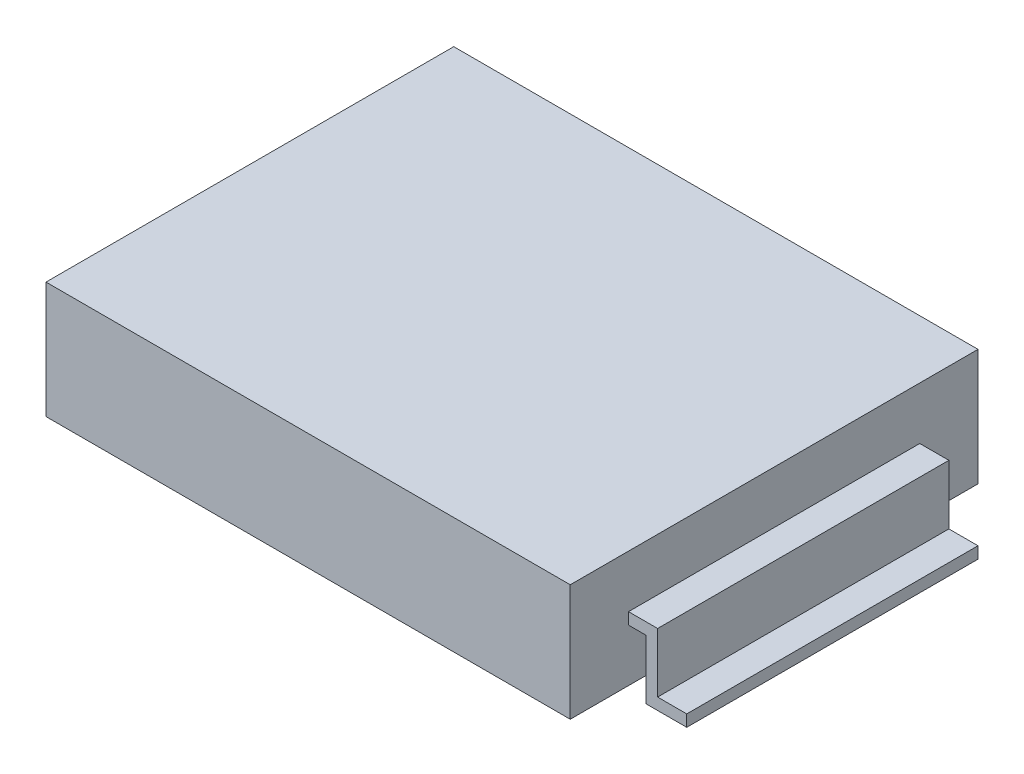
ISO-10303-21;
HEADER;
FILE_DESCRIPTION(('STEP AP214'),'2;1');
FILE_NAME('part.step','',(''),(''),'','','');
FILE_SCHEMA(('AUTOMOTIVE_DESIGN { 1 0 10303 214 1 1 1 1 }'));
ENDSEC;
DATA;
#1=APPLICATION_CONTEXT('core data for automotive mechanical design processes');
#2=APPLICATION_PROTOCOL_DEFINITION('international standard','automotive_design',2000,#1);
#3=PRODUCT_CONTEXT('',#1,'mechanical');
#4=PRODUCT('Part','Part','',(#3));
#5=PRODUCT_RELATED_PRODUCT_CATEGORY('part','',(#4));
#6=PRODUCT_DEFINITION_FORMATION('','',#4);
#7=PRODUCT_DEFINITION_CONTEXT('part definition',#1,'design');
#8=PRODUCT_DEFINITION('design','',#6,#7);
#9=PRODUCT_DEFINITION_SHAPE('','',#8);
#10=(LENGTH_UNIT() NAMED_UNIT(*) SI_UNIT(.MILLI.,.METRE.));
#11=(NAMED_UNIT(*) PLANE_ANGLE_UNIT() SI_UNIT($,.RADIAN.));
#12=(NAMED_UNIT(*) SI_UNIT($,.STERADIAN.) SOLID_ANGLE_UNIT());
#13=UNCERTAINTY_MEASURE_WITH_UNIT(LENGTH_MEASURE(1.E-05),#10,'distance_accuracy_value','');
#14=(GEOMETRIC_REPRESENTATION_CONTEXT(3) GLOBAL_UNCERTAINTY_ASSIGNED_CONTEXT((#13)) GLOBAL_UNIT_ASSIGNED_CONTEXT((#10,
#11,#12)) REPRESENTATION_CONTEXT('',''));
#15=CARTESIAN_POINT('',(0.,0.,0.));
#16=DIRECTION('',(0.,0.,1.));
#17=DIRECTION('',(1.,0.,0.));
#18=AXIS2_PLACEMENT_3D('',#15,#16,#17);
#19=CARTESIAN_POINT('',(-2.25,0.5,-1.75));
#20=DIRECTION('',(1.,0.,0.));
#21=DIRECTION('',(0.,0.,-1.));
#22=AXIS2_PLACEMENT_3D('',#19,#20,#21);
#23=PLANE('',#22);
#24=DIRECTION('',(0.,0.,1.));
#25=VECTOR('',#24,1.);
#26=CARTESIAN_POINT('',(-2.25,-0.5,-1.75));
#27=LINE('',#26,#25);
#28=CARTESIAN_POINT('',(-2.25,-0.5,-1.75));
#29=VERTEX_POINT('',#28);
#30=CARTESIAN_POINT('',(-2.25,-0.5,1.75));
#31=VERTEX_POINT('',#30);
#32=EDGE_CURVE('E300',#29,#31,#27,.T.);
#33=ORIENTED_EDGE('',*,*,#32,.T.);
#34=DIRECTION('',(0.,-1.,0.));
#35=VECTOR('',#34,1.);
#36=CARTESIAN_POINT('',(-2.25,0.5,1.75));
#37=LINE('',#36,#35);
#38=CARTESIAN_POINT('',(-2.25,0.5,1.75));
#39=VERTEX_POINT('',#38);
#40=EDGE_CURVE('E11',#39,#31,#37,.T.);
#41=ORIENTED_EDGE('',*,*,#40,.F.);
#42=DIRECTION('',(0.,0.,1.));
#43=VECTOR('',#42,1.);
#44=CARTESIAN_POINT('',(-2.25,0.5,-1.75));
#45=LINE('',#44,#43);
#46=CARTESIAN_POINT('',(-2.25,0.5,-1.75));
#47=VERTEX_POINT('',#46);
#48=EDGE_CURVE('E301',#47,#39,#45,.T.);
#49=ORIENTED_EDGE('',*,*,#48,.F.);
#50=DIRECTION('',(0.,-1.,0.));
#51=VECTOR('',#50,1.);
#52=CARTESIAN_POINT('',(-2.25,0.5,-1.75));
#53=LINE('',#52,#51);
#54=EDGE_CURVE('E311',#47,#29,#53,.T.);
#55=ORIENTED_EDGE('',*,*,#54,.T.);
#56=EDGE_LOOP('',(#33,#41,#49,#55));
#57=FACE_BOUND('',#56,.T.);
#58=DIRECTION('',(0.,-1.,0.));
#59=VECTOR('',#58,1.);
#60=CARTESIAN_POINT('',(-2.25,0.0499999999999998,1.25));
#61=LINE('',#60,#59);
#62=CARTESIAN_POINT('',(-2.25,0.0499999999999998,1.25));
#63=VERTEX_POINT('',#62);
#64=CARTESIAN_POINT('',(-2.25,-0.0500000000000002,1.25));
#65=VERTEX_POINT('',#64);
#66=EDGE_CURVE('E253',#63,#65,#61,.T.);
#67=ORIENTED_EDGE('',*,*,#66,.T.);
#68=DIRECTION('',(0.,0.,-1.));
#69=VECTOR('',#68,1.);
#70=CARTESIAN_POINT('',(-2.25,-0.0500000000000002,1.25));
#71=LINE('',#70,#69);
#72=CARTESIAN_POINT('',(-2.25,-0.0500000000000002,-1.25));
#73=VERTEX_POINT('',#72);
#74=EDGE_CURVE('E289',#65,#73,#71,.T.);
#75=ORIENTED_EDGE('',*,*,#74,.T.);
#76=DIRECTION('',(0.,-1.,0.));
#77=VECTOR('',#76,1.);
#78=CARTESIAN_POINT('',(-2.25,0.0499999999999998,-1.25));
#79=LINE('',#78,#77);
#80=CARTESIAN_POINT('',(-2.25,0.0499999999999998,-1.25));
#81=VERTEX_POINT('',#80);
#82=EDGE_CURVE('E275',#81,#73,#79,.T.);
#83=ORIENTED_EDGE('',*,*,#82,.F.);
#84=DIRECTION('',(0.,0.,-1.));
#85=VECTOR('',#84,1.);
#86=CARTESIAN_POINT('',(-2.25,0.0499999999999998,1.25));
#87=LINE('',#86,#85);
#88=EDGE_CURVE('E286',#63,#81,#87,.T.);
#89=ORIENTED_EDGE('',*,*,#88,.F.);
#90=EDGE_LOOP('',(#67,#75,#83,#89));
#91=FACE_BOUND('',#90,.T.);
#92=ADVANCED_FACE('F36',(#57,#91),#23,.F.);
#93=CARTESIAN_POINT('',(-2.25,0.5,1.75));
#94=DIRECTION('',(0.,0.,-1.));
#95=DIRECTION('',(-1.,0.,0.));
#96=AXIS2_PLACEMENT_3D('',#93,#94,#95);
#97=PLANE('',#96);
#98=DIRECTION('',(1.,0.,0.));
#99=VECTOR('',#98,1.);
#100=CARTESIAN_POINT('',(-2.25,-0.5,1.75));
#101=LINE('',#100,#99);
#102=CARTESIAN_POINT('',(2.25,-0.5,1.75));
#103=VERTEX_POINT('',#102);
#104=EDGE_CURVE('E314',#31,#103,#101,.T.);
#105=ORIENTED_EDGE('',*,*,#104,.T.);
#106=DIRECTION('',(0.,-1.,0.));
#107=VECTOR('',#106,1.);
#108=CARTESIAN_POINT('',(2.25,0.5,1.75));
#109=LINE('',#108,#107);
#110=CARTESIAN_POINT('',(2.25,0.5,1.75));
#111=VERTEX_POINT('',#110);
#112=EDGE_CURVE('E43',#111,#103,#109,.T.);
#113=ORIENTED_EDGE('',*,*,#112,.F.);
#114=DIRECTION('',(1.,0.,0.));
#115=VECTOR('',#114,1.);
#116=CARTESIAN_POINT('',(-2.25,0.5,1.75));
#117=LINE('',#116,#115);
#118=EDGE_CURVE('E304',#39,#111,#117,.T.);
#119=ORIENTED_EDGE('',*,*,#118,.F.);
#120=ORIENTED_EDGE('',*,*,#40,.T.);
#121=EDGE_LOOP('',(#105,#113,#119,#120));
#122=FACE_BOUND('',#121,.T.);
#123=ADVANCED_FACE('F345',(#122),#97,.F.);
#124=CARTESIAN_POINT('',(2.25,0.5,-1.75));
#125=DIRECTION('',(-1.,0.,0.));
#126=DIRECTION('',(0.,0.,1.));
#127=AXIS2_PLACEMENT_3D('',#124,#125,#126);
#128=PLANE('',#127);
#129=DIRECTION('',(0.,0.,-1.));
#130=VECTOR('',#129,1.);
#131=CARTESIAN_POINT('',(2.25,-0.0500000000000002,1.25));
#132=LINE('',#131,#130);
#133=CARTESIAN_POINT('',(2.25,-0.0500000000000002,1.25));
#134=VERTEX_POINT('',#133);
#135=CARTESIAN_POINT('',(2.25,-0.0500000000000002,-1.25));
#136=VERTEX_POINT('',#135);
#137=EDGE_CURVE('E55',#134,#136,#132,.T.);
#138=ORIENTED_EDGE('',*,*,#137,.F.);
#139=DIRECTION('',(0.,-1.,0.));
#140=VECTOR('',#139,1.);
#141=CARTESIAN_POINT('',(2.25,0.0499999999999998,1.25));
#142=LINE('',#141,#140);
#143=CARTESIAN_POINT('',(2.25,0.0499999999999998,1.25));
#144=VERTEX_POINT('',#143);
#145=EDGE_CURVE('E50',#144,#134,#142,.T.);
#146=ORIENTED_EDGE('',*,*,#145,.F.);
#147=DIRECTION('',(0.,0.,-1.));
#148=VECTOR('',#147,1.);
#149=CARTESIAN_POINT('',(2.25,0.0499999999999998,1.25));
#150=LINE('',#149,#148);
#151=CARTESIAN_POINT('',(2.25,0.0499999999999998,-1.25));
#152=VERTEX_POINT('',#151);
#153=EDGE_CURVE('E235',#144,#152,#150,.T.);
#154=ORIENTED_EDGE('',*,*,#153,.T.);
#155=DIRECTION('',(0.,-1.,0.));
#156=VECTOR('',#155,1.);
#157=CARTESIAN_POINT('',(2.25,0.0499999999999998,-1.25));
#158=LINE('',#157,#156);
#159=EDGE_CURVE('E214',#152,#136,#158,.T.);
#160=ORIENTED_EDGE('',*,*,#159,.T.);
#161=EDGE_LOOP('',(#138,#146,#154,#160));
#162=FACE_BOUND('',#161,.T.);
#163=DIRECTION('',(0.,0.,-1.));
#164=VECTOR('',#163,1.);
#165=CARTESIAN_POINT('',(2.25,-0.5,-1.75));
#166=LINE('',#165,#164);
#167=CARTESIAN_POINT('',(2.25,-0.5,-1.75));
#168=VERTEX_POINT('',#167);
#169=EDGE_CURVE('E316',#103,#168,#166,.T.);
#170=ORIENTED_EDGE('',*,*,#169,.T.);
#171=DIRECTION('',(0.,-1.,0.));
#172=VECTOR('',#171,1.);
#173=CARTESIAN_POINT('',(2.25,0.5,-1.75));
#174=LINE('',#173,#172);
#175=CARTESIAN_POINT('',(2.25,0.5,-1.75));
#176=VERTEX_POINT('',#175);
#177=EDGE_CURVE('E321',#176,#168,#174,.T.);
#178=ORIENTED_EDGE('',*,*,#177,.F.);
#179=DIRECTION('',(0.,0.,-1.));
#180=VECTOR('',#179,1.);
#181=CARTESIAN_POINT('',(2.25,0.5,-1.75));
#182=LINE('',#181,#180);
#183=EDGE_CURVE('E307',#111,#176,#182,.T.);
#184=ORIENTED_EDGE('',*,*,#183,.F.);
#185=ORIENTED_EDGE('',*,*,#112,.T.);
#186=EDGE_LOOP('',(#170,#178,#184,#185));
#187=FACE_BOUND('',#186,.T.);
#188=ADVANCED_FACE('F328',(#162,#187),#128,.F.);
#189=CARTESIAN_POINT('',(-2.25,0.5,-1.75));
#190=DIRECTION('',(0.,0.,1.));
#191=DIRECTION('',(1.,0.,0.));
#192=AXIS2_PLACEMENT_3D('',#189,#190,#191);
#193=PLANE('',#192);
#194=DIRECTION('',(-1.,0.,0.));
#195=VECTOR('',#194,1.);
#196=CARTESIAN_POINT('',(-2.25,-0.5,-1.75));
#197=LINE('',#196,#195);
#198=EDGE_CURVE('E305',#168,#29,#197,.T.);
#199=ORIENTED_EDGE('',*,*,#198,.T.);
#200=ORIENTED_EDGE('',*,*,#54,.F.);
#201=DIRECTION('',(-1.,0.,0.));
#202=VECTOR('',#201,1.);
#203=CARTESIAN_POINT('',(-2.25,0.5,-1.75));
#204=LINE('',#203,#202);
#205=EDGE_CURVE('E309',#176,#47,#204,.T.);
#206=ORIENTED_EDGE('',*,*,#205,.F.);
#207=ORIENTED_EDGE('',*,*,#177,.T.);
#208=EDGE_LOOP('',(#199,#200,#206,#207));
#209=FACE_BOUND('',#208,.T.);
#210=ADVANCED_FACE('F337',(#209),#193,.F.);
#211=CARTESIAN_POINT('',(-2.25,0.5,1.75));
#212=DIRECTION('',(0.,1.,0.));
#213=DIRECTION('',(0.,0.,1.));
#214=AXIS2_PLACEMENT_3D('',#211,#212,#213);
#215=PLANE('',#214);
#216=ORIENTED_EDGE('',*,*,#48,.T.);
#217=ORIENTED_EDGE('',*,*,#118,.T.);
#218=ORIENTED_EDGE('',*,*,#183,.T.);
#219=ORIENTED_EDGE('',*,*,#205,.T.);
#220=EDGE_LOOP('',(#216,#217,#218,#219));
#221=FACE_BOUND('',#220,.T.);
#222=ADVANCED_FACE('F344',(#221),#215,.T.);
#223=CARTESIAN_POINT('',(-2.25,-0.5,1.75));
#224=DIRECTION('',(0.,1.,0.));
#225=DIRECTION('',(0.,0.,1.));
#226=AXIS2_PLACEMENT_3D('',#223,#224,#225);
#227=PLANE('',#226);
#228=ORIENTED_EDGE('',*,*,#32,.F.);
#229=ORIENTED_EDGE('',*,*,#198,.F.);
#230=ORIENTED_EDGE('',*,*,#169,.F.);
#231=ORIENTED_EDGE('',*,*,#104,.F.);
#232=EDGE_LOOP('',(#228,#229,#230,#231));
#233=FACE_BOUND('',#232,.T.);
#234=ADVANCED_FACE('F334',(#233),#227,.F.);
#235=CARTESIAN_POINT('',(-2.45,-0.459999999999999,1.25));
#236=DIRECTION('',(0.,-1.,0.));
#237=DIRECTION('',(1.,0.,0.));
#238=AXIS2_PLACEMENT_3D('',#235,#236,#237);
#239=PLANE('',#238);
#240=DIRECTION('',(-1.,0.,0.));
#241=VECTOR('',#240,1.);
#242=CARTESIAN_POINT('',(-2.45,-0.459999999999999,-1.25));
#243=LINE('',#242,#241);
#244=CARTESIAN_POINT('',(-2.5,-0.459999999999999,-1.25));
#245=VERTEX_POINT('',#244);
#246=CARTESIAN_POINT('',(-2.75,-0.459999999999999,-1.25));
#247=VERTEX_POINT('',#246);
#248=EDGE_CURVE('E180',#245,#247,#243,.T.);
#249=ORIENTED_EDGE('',*,*,#248,.T.);
#250=DIRECTION('',(0.,0.,-1.));
#251=VECTOR('',#250,1.);
#252=CARTESIAN_POINT('',(-2.75,-0.459999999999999,1.25));
#253=LINE('',#252,#251);
#254=CARTESIAN_POINT('',(-2.75,-0.459999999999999,1.25));
#255=VERTEX_POINT('',#254);
#256=EDGE_CURVE('E298',#255,#247,#253,.T.);
#257=ORIENTED_EDGE('',*,*,#256,.F.);
#258=DIRECTION('',(-1.,0.,0.));
#259=VECTOR('',#258,1.);
#260=CARTESIAN_POINT('',(-2.45,-0.459999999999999,1.25));
#261=LINE('',#260,#259);
#262=CARTESIAN_POINT('',(-2.5,-0.459999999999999,1.25));
#263=VERTEX_POINT('',#262);
#264=EDGE_CURVE('E238',#263,#255,#261,.T.);
#265=ORIENTED_EDGE('',*,*,#264,.F.);
#266=DIRECTION('',(0.,0.,-1.));
#267=VECTOR('',#266,1.);
#268=CARTESIAN_POINT('',(-2.5,-0.459999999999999,1.25));
#269=LINE('',#268,#267);
#270=EDGE_CURVE('E260',#263,#245,#269,.T.);
#271=ORIENTED_EDGE('',*,*,#270,.T.);
#272=EDGE_LOOP('',(#249,#257,#265,#271));
#273=FACE_BOUND('',#272,.T.);
#274=ADVANCED_FACE('F357',(#273),#239,.F.);
#275=CARTESIAN_POINT('',(-2.75,-0.559999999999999,1.25));
#276=DIRECTION('',(-1.,0.,0.));
#277=DIRECTION('',(0.,0.,1.));
#278=AXIS2_PLACEMENT_3D('',#275,#276,#277);
#279=PLANE('',#278);
#280=DIRECTION('',(0.,1.,0.));
#281=VECTOR('',#280,1.);
#282=CARTESIAN_POINT('',(-2.75,-0.559999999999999,-1.25));
#283=LINE('',#282,#281);
#284=CARTESIAN_POINT('',(-2.75,-0.559999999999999,-1.25));
#285=VERTEX_POINT('',#284);
#286=EDGE_CURVE('E263',#285,#247,#283,.T.);
#287=ORIENTED_EDGE('',*,*,#286,.F.);
#288=DIRECTION('',(0.,0.,-1.));
#289=VECTOR('',#288,1.);
#290=CARTESIAN_POINT('',(-2.75,-0.559999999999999,1.25));
#291=LINE('',#290,#289);
#292=CARTESIAN_POINT('',(-2.75,-0.559999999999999,1.25));
#293=VERTEX_POINT('',#292);
#294=EDGE_CURVE('E296',#293,#285,#291,.T.);
#295=ORIENTED_EDGE('',*,*,#294,.F.);
#296=DIRECTION('',(0.,1.,0.));
#297=VECTOR('',#296,1.);
#298=CARTESIAN_POINT('',(-2.75,-0.559999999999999,1.25));
#299=LINE('',#298,#297);
#300=EDGE_CURVE('E240',#293,#255,#299,.T.);
#301=ORIENTED_EDGE('',*,*,#300,.T.);
#302=ORIENTED_EDGE('',*,*,#256,.T.);
#303=EDGE_LOOP('',(#287,#295,#301,#302));
#304=FACE_BOUND('',#303,.T.);
#305=ADVANCED_FACE('F362',(#304),#279,.T.);
#306=CARTESIAN_POINT('',(-2.45,-0.559999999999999,1.25));
#307=DIRECTION('',(0.,-1.,0.));
#308=DIRECTION('',(1.,0.,0.));
#309=AXIS2_PLACEMENT_3D('',#306,#307,#308);
#310=PLANE('',#309);
#311=DIRECTION('',(-1.,0.,0.));
#312=VECTOR('',#311,1.);
#313=CARTESIAN_POINT('',(-2.45,-0.559999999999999,-1.25));
#314=LINE('',#313,#312);
#315=CARTESIAN_POINT('',(-2.4,-0.559999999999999,-1.25));
#316=VERTEX_POINT('',#315);
#317=EDGE_CURVE('E266',#316,#285,#314,.T.);
#318=ORIENTED_EDGE('',*,*,#317,.F.);
#319=DIRECTION('',(0.,0.,-1.));
#320=VECTOR('',#319,1.);
#321=CARTESIAN_POINT('',(-2.4,-0.559999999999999,1.25));
#322=LINE('',#321,#320);
#323=CARTESIAN_POINT('',(-2.4,-0.559999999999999,1.25));
#324=VERTEX_POINT('',#323);
#325=EDGE_CURVE('E294',#324,#316,#322,.T.);
#326=ORIENTED_EDGE('',*,*,#325,.F.);
#327=DIRECTION('',(-1.,0.,0.));
#328=VECTOR('',#327,1.);
#329=CARTESIAN_POINT('',(-2.45,-0.559999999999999,1.25));
#330=LINE('',#329,#328);
#331=EDGE_CURVE('E244',#324,#293,#330,.T.);
#332=ORIENTED_EDGE('',*,*,#331,.T.);
#333=ORIENTED_EDGE('',*,*,#294,.T.);
#334=EDGE_LOOP('',(#318,#326,#332,#333));
#335=FACE_BOUND('',#334,.T.);
#336=ADVANCED_FACE('F366',(#335),#310,.T.);
#337=CARTESIAN_POINT('',(-2.4,0.,1.25));
#338=DIRECTION('',(1.,0.,0.));
#339=DIRECTION('',(0.,0.,-1.));
#340=AXIS2_PLACEMENT_3D('',#337,#338,#339);
#341=PLANE('',#340);
#342=DIRECTION('',(0.,1.,0.));
#343=VECTOR('',#342,1.);
#344=CARTESIAN_POINT('',(-2.4,0.,-1.25));
#345=LINE('',#344,#343);
#346=CARTESIAN_POINT('',(-2.4,-0.0500000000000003,-1.25));
#347=VERTEX_POINT('',#346);
#348=EDGE_CURVE('E269',#347,#316,#345,.F.);
#349=ORIENTED_EDGE('',*,*,#348,.F.);
#350=DIRECTION('',(0.,0.,-1.));
#351=VECTOR('',#350,1.);
#352=CARTESIAN_POINT('',(-2.4,-0.0500000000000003,1.25));
#353=LINE('',#352,#351);
#354=CARTESIAN_POINT('',(-2.4,-0.0500000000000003,1.25));
#355=VERTEX_POINT('',#354);
#356=EDGE_CURVE('E292',#355,#347,#353,.T.);
#357=ORIENTED_EDGE('',*,*,#356,.F.);
#358=DIRECTION('',(0.,1.,0.));
#359=VECTOR('',#358,1.);
#360=CARTESIAN_POINT('',(-2.4,0.,1.25));
#361=LINE('',#360,#359);
#362=EDGE_CURVE('E247',#355,#324,#361,.F.);
#363=ORIENTED_EDGE('',*,*,#362,.T.);
#364=ORIENTED_EDGE('',*,*,#325,.T.);
#365=EDGE_LOOP('',(#349,#357,#363,#364));
#366=FACE_BOUND('',#365,.T.);
#367=ADVANCED_FACE('F370',(#366),#341,.T.);
#368=CARTESIAN_POINT('',(-2.25,-0.0500000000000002,1.25));
#369=DIRECTION('',(0.,-1.,0.));
#370=DIRECTION('',(1.,0.,0.));
#371=AXIS2_PLACEMENT_3D('',#368,#369,#370);
#372=PLANE('',#371);
#373=DIRECTION('',(-1.,0.,0.));
#374=VECTOR('',#373,1.);
#375=CARTESIAN_POINT('',(-2.25,-0.0500000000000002,-1.25));
#376=LINE('',#375,#374);
#377=EDGE_CURVE('E272',#73,#347,#376,.T.);
#378=ORIENTED_EDGE('',*,*,#377,.F.);
#379=ORIENTED_EDGE('',*,*,#74,.F.);
#380=DIRECTION('',(-1.,0.,0.));
#381=VECTOR('',#380,1.);
#382=CARTESIAN_POINT('',(-2.25,-0.0500000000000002,1.25));
#383=LINE('',#382,#381);
#384=EDGE_CURVE('E250',#65,#355,#383,.T.);
#385=ORIENTED_EDGE('',*,*,#384,.T.);
#386=ORIENTED_EDGE('',*,*,#356,.T.);
#387=EDGE_LOOP('',(#378,#379,#385,#386));
#388=FACE_BOUND('',#387,.T.);
#389=ADVANCED_FACE('F374',(#388),#372,.T.);
#390=CARTESIAN_POINT('',(-2.25,0.0499999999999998,1.25));
#391=DIRECTION('',(0.,-1.,0.));
#392=DIRECTION('',(1.,0.,0.));
#393=AXIS2_PLACEMENT_3D('',#390,#391,#392);
#394=PLANE('',#393);
#395=DIRECTION('',(-1.,0.,0.));
#396=VECTOR('',#395,1.);
#397=CARTESIAN_POINT('',(-2.25,0.0499999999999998,-1.25));
#398=LINE('',#397,#396);
#399=CARTESIAN_POINT('',(-2.5,0.0499999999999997,-1.25));
#400=VERTEX_POINT('',#399);
#401=EDGE_CURVE('E278',#81,#400,#398,.T.);
#402=ORIENTED_EDGE('',*,*,#401,.T.);
#403=DIRECTION('',(0.,0.,-1.));
#404=VECTOR('',#403,1.);
#405=CARTESIAN_POINT('',(-2.5,0.0499999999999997,1.25));
#406=LINE('',#405,#404);
#407=CARTESIAN_POINT('',(-2.5,0.0499999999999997,1.25));
#408=VERTEX_POINT('',#407);
#409=EDGE_CURVE('E283',#408,#400,#406,.T.);
#410=ORIENTED_EDGE('',*,*,#409,.F.);
#411=DIRECTION('',(-1.,0.,0.));
#412=VECTOR('',#411,1.);
#413=CARTESIAN_POINT('',(-2.25,0.0499999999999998,1.25));
#414=LINE('',#413,#412);
#415=EDGE_CURVE('E256',#63,#408,#414,.T.);
#416=ORIENTED_EDGE('',*,*,#415,.F.);
#417=ORIENTED_EDGE('',*,*,#88,.T.);
#418=EDGE_LOOP('',(#402,#410,#416,#417));
#419=FACE_BOUND('',#418,.T.);
#420=ADVANCED_FACE('F378',(#419),#394,.F.);
#421=CARTESIAN_POINT('',(-2.5,0.,1.25));
#422=DIRECTION('',(1.,0.,0.));
#423=DIRECTION('',(0.,0.,-1.));
#424=AXIS2_PLACEMENT_3D('',#421,#422,#423);
#425=PLANE('',#424);
#426=DIRECTION('',(0.,1.,0.));
#427=VECTOR('',#426,1.);
#428=CARTESIAN_POINT('',(-2.5,0.,-1.25));
#429=LINE('',#428,#427);
#430=EDGE_CURVE('E241',#400,#245,#429,.F.);
#431=ORIENTED_EDGE('',*,*,#430,.T.);
#432=ORIENTED_EDGE('',*,*,#270,.F.);
#433=DIRECTION('',(0.,1.,0.));
#434=VECTOR('',#433,1.);
#435=CARTESIAN_POINT('',(-2.5,0.,1.25));
#436=LINE('',#435,#434);
#437=EDGE_CURVE('E258',#408,#263,#436,.F.);
#438=ORIENTED_EDGE('',*,*,#437,.F.);
#439=ORIENTED_EDGE('',*,*,#409,.T.);
#440=EDGE_LOOP('',(#431,#432,#438,#439));
#441=FACE_BOUND('',#440,.T.);
#442=ADVANCED_FACE('F382',(#441),#425,.F.);
#443=CARTESIAN_POINT('',(-2.75,-0.459999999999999,1.25));
#444=DIRECTION('',(0.,0.,-1.));
#445=DIRECTION('',(-1.,0.,0.));
#446=AXIS2_PLACEMENT_3D('',#443,#444,#445);
#447=PLANE('',#446);
#448=ORIENTED_EDGE('',*,*,#264,.T.);
#449=ORIENTED_EDGE('',*,*,#300,.F.);
#450=ORIENTED_EDGE('',*,*,#331,.F.);
#451=ORIENTED_EDGE('',*,*,#362,.F.);
#452=ORIENTED_EDGE('',*,*,#384,.F.);
#453=ORIENTED_EDGE('',*,*,#66,.F.);
#454=ORIENTED_EDGE('',*,*,#415,.T.);
#455=ORIENTED_EDGE('',*,*,#437,.T.);
#456=EDGE_LOOP('',(#448,#449,#450,#451,#452,#453,#454,#455));
#457=FACE_BOUND('',#456,.T.);
#458=ADVANCED_FACE('F386',(#457),#447,.F.);
#459=CARTESIAN_POINT('',(-2.75,-0.459999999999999,-1.25));
#460=DIRECTION('',(0.,0.,-1.));
#461=DIRECTION('',(-1.,0.,0.));
#462=AXIS2_PLACEMENT_3D('',#459,#460,#461);
#463=PLANE('',#462);
#464=ORIENTED_EDGE('',*,*,#248,.F.);
#465=ORIENTED_EDGE('',*,*,#430,.F.);
#466=ORIENTED_EDGE('',*,*,#401,.F.);
#467=ORIENTED_EDGE('',*,*,#82,.T.);
#468=ORIENTED_EDGE('',*,*,#377,.T.);
#469=ORIENTED_EDGE('',*,*,#348,.T.);
#470=ORIENTED_EDGE('',*,*,#317,.T.);
#471=ORIENTED_EDGE('',*,*,#286,.T.);
#472=EDGE_LOOP('',(#464,#465,#466,#467,#468,#469,#470,#471));
#473=FACE_BOUND('',#472,.T.);
#474=ADVANCED_FACE('F388',(#473),#463,.T.);
#475=CARTESIAN_POINT('',(2.45,-0.459999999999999,1.25));
#476=DIRECTION('',(0.,1.,0.));
#477=DIRECTION('',(-1.,0.,0.));
#478=AXIS2_PLACEMENT_3D('',#475,#476,#477);
#479=PLANE('',#478);
#480=DIRECTION('',(1.,0.,0.));
#481=VECTOR('',#480,1.);
#482=CARTESIAN_POINT('',(2.45,-0.459999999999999,-1.25));
#483=LINE('',#482,#481);
#484=CARTESIAN_POINT('',(2.5,-0.459999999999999,-1.25));
#485=VERTEX_POINT('',#484);
#486=CARTESIAN_POINT('',(2.75,-0.459999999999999,-1.25));
#487=VERTEX_POINT('',#486);
#488=EDGE_CURVE('E175',#485,#487,#483,.T.);
#489=ORIENTED_EDGE('',*,*,#488,.F.);
#490=DIRECTION('',(0.,0.,-1.));
#491=VECTOR('',#490,1.);
#492=CARTESIAN_POINT('',(2.5,-0.459999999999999,1.25));
#493=LINE('',#492,#491);
#494=CARTESIAN_POINT('',(2.5,-0.459999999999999,1.25));
#495=VERTEX_POINT('',#494);
#496=EDGE_CURVE('E170',#495,#485,#493,.T.);
#497=ORIENTED_EDGE('',*,*,#496,.F.);
#498=DIRECTION('',(1.,0.,0.));
#499=VECTOR('',#498,1.);
#500=CARTESIAN_POINT('',(2.45,-0.459999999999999,1.25));
#501=LINE('',#500,#499);
#502=CARTESIAN_POINT('',(2.75,-0.459999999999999,1.25));
#503=VERTEX_POINT('',#502);
#504=EDGE_CURVE('E173',#495,#503,#501,.T.);
#505=ORIENTED_EDGE('',*,*,#504,.T.);
#506=DIRECTION('',(0.,0.,-1.));
#507=VECTOR('',#506,1.);
#508=CARTESIAN_POINT('',(2.75,-0.459999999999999,1.25));
#509=LINE('',#508,#507);
#510=EDGE_CURVE('E207',#503,#487,#509,.T.);
#511=ORIENTED_EDGE('',*,*,#510,.T.);
#512=EDGE_LOOP('',(#489,#497,#505,#511));
#513=FACE_BOUND('',#512,.T.);
#514=ADVANCED_FACE('F172',(#513),#479,.T.);
#515=CARTESIAN_POINT('',(2.5,0.,1.25));
#516=DIRECTION('',(1.,0.,0.));
#517=DIRECTION('',(0.,0.,-1.));
#518=AXIS2_PLACEMENT_3D('',#515,#516,#517);
#519=PLANE('',#518);
#520=DIRECTION('',(0.,1.,0.));
#521=VECTOR('',#520,1.);
#522=CARTESIAN_POINT('',(2.5,0.,-1.25));
#523=LINE('',#522,#521);
#524=CARTESIAN_POINT('',(2.5,0.0499999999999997,-1.25));
#525=VERTEX_POINT('',#524);
#526=EDGE_CURVE('E209',#525,#485,#523,.F.);
#527=ORIENTED_EDGE('',*,*,#526,.F.);
#528=DIRECTION('',(0.,0.,-1.));
#529=VECTOR('',#528,1.);
#530=CARTESIAN_POINT('',(2.5,0.0499999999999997,1.25));
#531=LINE('',#530,#529);
#532=CARTESIAN_POINT('',(2.5,0.0499999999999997,1.25));
#533=VERTEX_POINT('',#532);
#534=EDGE_CURVE('E181',#533,#525,#531,.T.);
#535=ORIENTED_EDGE('',*,*,#534,.F.);
#536=DIRECTION('',(0.,1.,0.));
#537=VECTOR('',#536,1.);
#538=CARTESIAN_POINT('',(2.5,0.,1.25));
#539=LINE('',#538,#537);
#540=EDGE_CURVE('E187',#533,#495,#539,.F.);
#541=ORIENTED_EDGE('',*,*,#540,.T.);
#542=ORIENTED_EDGE('',*,*,#496,.T.);
#543=EDGE_LOOP('',(#527,#535,#541,#542));
#544=FACE_BOUND('',#543,.T.);
#545=ADVANCED_FACE('F194',(#544),#519,.T.);
#546=CARTESIAN_POINT('',(2.25,0.0499999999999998,1.25));
#547=DIRECTION('',(0.,1.,0.));
#548=DIRECTION('',(-1.,0.,0.));
#549=AXIS2_PLACEMENT_3D('',#546,#547,#548);
#550=PLANE('',#549);
#551=DIRECTION('',(1.,0.,0.));
#552=VECTOR('',#551,1.);
#553=CARTESIAN_POINT('',(2.25,0.0499999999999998,-1.25));
#554=LINE('',#553,#552);
#555=EDGE_CURVE('E211',#152,#525,#554,.T.);
#556=ORIENTED_EDGE('',*,*,#555,.F.);
#557=ORIENTED_EDGE('',*,*,#153,.F.);
#558=DIRECTION('',(1.,0.,0.));
#559=VECTOR('',#558,1.);
#560=CARTESIAN_POINT('',(2.25,0.0499999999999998,1.25));
#561=LINE('',#560,#559);
#562=EDGE_CURVE('E195',#144,#533,#561,.T.);
#563=ORIENTED_EDGE('',*,*,#562,.T.);
#564=ORIENTED_EDGE('',*,*,#534,.T.);
#565=EDGE_LOOP('',(#556,#557,#563,#564));
#566=FACE_BOUND('',#565,.T.);
#567=ADVANCED_FACE('F399',(#566),#550,.T.);
#568=CARTESIAN_POINT('',(2.25,-0.0500000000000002,1.25));
#569=DIRECTION('',(0.,1.,0.));
#570=DIRECTION('',(-1.,0.,0.));
#571=AXIS2_PLACEMENT_3D('',#568,#569,#570);
#572=PLANE('',#571);
#573=DIRECTION('',(1.,0.,0.));
#574=VECTOR('',#573,1.);
#575=CARTESIAN_POINT('',(2.25,-0.0500000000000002,-1.25));
#576=LINE('',#575,#574);
#577=CARTESIAN_POINT('',(2.4,-0.0500000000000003,-1.25));
#578=VERTEX_POINT('',#577);
#579=EDGE_CURVE('E216',#136,#578,#576,.T.);
#580=ORIENTED_EDGE('',*,*,#579,.T.);
#581=DIRECTION('',(0.,0.,-1.));
#582=VECTOR('',#581,1.);
#583=CARTESIAN_POINT('',(2.4,-0.0500000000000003,1.25));
#584=LINE('',#583,#582);
#585=CARTESIAN_POINT('',(2.4,-0.0500000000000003,1.25));
#586=VERTEX_POINT('',#585);
#587=EDGE_CURVE('E231',#586,#578,#584,.T.);
#588=ORIENTED_EDGE('',*,*,#587,.F.);
#589=DIRECTION('',(1.,0.,0.));
#590=VECTOR('',#589,1.);
#591=CARTESIAN_POINT('',(2.25,-0.0500000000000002,1.25));
#592=LINE('',#591,#590);
#593=EDGE_CURVE('E200',#134,#586,#592,.T.);
#594=ORIENTED_EDGE('',*,*,#593,.F.);
#595=ORIENTED_EDGE('',*,*,#137,.T.);
#596=EDGE_LOOP('',(#580,#588,#594,#595));
#597=FACE_BOUND('',#596,.T.);
#598=ADVANCED_FACE('F402',(#597),#572,.F.);
#599=CARTESIAN_POINT('',(2.4,0.,1.25));
#600=DIRECTION('',(1.,0.,0.));
#601=DIRECTION('',(0.,0.,-1.));
#602=AXIS2_PLACEMENT_3D('',#599,#600,#601);
#603=PLANE('',#602);
#604=DIRECTION('',(0.,1.,0.));
#605=VECTOR('',#604,1.);
#606=CARTESIAN_POINT('',(2.4,0.,-1.25));
#607=LINE('',#606,#605);
#608=CARTESIAN_POINT('',(2.4,-0.559999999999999,-1.25));
#609=VERTEX_POINT('',#608);
#610=EDGE_CURVE('E218',#578,#609,#607,.F.);
#611=ORIENTED_EDGE('',*,*,#610,.T.);
#612=DIRECTION('',(0.,0.,-1.));
#613=VECTOR('',#612,1.);
#614=CARTESIAN_POINT('',(2.4,-0.559999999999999,1.25));
#615=LINE('',#614,#613);
#616=CARTESIAN_POINT('',(2.4,-0.559999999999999,1.25));
#617=VERTEX_POINT('',#616);
#618=EDGE_CURVE('E228',#617,#609,#615,.T.);
#619=ORIENTED_EDGE('',*,*,#618,.F.);
#620=DIRECTION('',(0.,1.,0.));
#621=VECTOR('',#620,1.);
#622=CARTESIAN_POINT('',(2.4,0.,1.25));
#623=LINE('',#622,#621);
#624=EDGE_CURVE('E202',#586,#617,#623,.F.);
#625=ORIENTED_EDGE('',*,*,#624,.F.);
#626=ORIENTED_EDGE('',*,*,#587,.T.);
#627=EDGE_LOOP('',(#611,#619,#625,#626));
#628=FACE_BOUND('',#627,.T.);
#629=ADVANCED_FACE('F406',(#628),#603,.F.);
#630=CARTESIAN_POINT('',(2.45,-0.559999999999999,1.25));
#631=DIRECTION('',(0.,1.,0.));
#632=DIRECTION('',(-1.,0.,0.));
#633=AXIS2_PLACEMENT_3D('',#630,#631,#632);
#634=PLANE('',#633);
#635=DIRECTION('',(1.,0.,0.));
#636=VECTOR('',#635,1.);
#637=CARTESIAN_POINT('',(2.45,-0.559999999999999,-1.25));
#638=LINE('',#637,#636);
#639=CARTESIAN_POINT('',(2.75,-0.559999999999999,-1.25));
#640=VERTEX_POINT('',#639);
#641=EDGE_CURVE('E220',#609,#640,#638,.T.);
#642=ORIENTED_EDGE('',*,*,#641,.T.);
#643=DIRECTION('',(0.,0.,-1.));
#644=VECTOR('',#643,1.);
#645=CARTESIAN_POINT('',(2.75,-0.559999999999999,1.25));
#646=LINE('',#645,#644);
#647=CARTESIAN_POINT('',(2.75,-0.559999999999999,1.25));
#648=VERTEX_POINT('',#647);
#649=EDGE_CURVE('E225',#648,#640,#646,.T.);
#650=ORIENTED_EDGE('',*,*,#649,.F.);
#651=DIRECTION('',(1.,0.,0.));
#652=VECTOR('',#651,1.);
#653=CARTESIAN_POINT('',(2.45,-0.559999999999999,1.25));
#654=LINE('',#653,#652);
#655=EDGE_CURVE('E204',#617,#648,#654,.T.);
#656=ORIENTED_EDGE('',*,*,#655,.F.);
#657=ORIENTED_EDGE('',*,*,#618,.T.);
#658=EDGE_LOOP('',(#642,#650,#656,#657));
#659=FACE_BOUND('',#658,.T.);
#660=ADVANCED_FACE('F410',(#659),#634,.F.);
#661=CARTESIAN_POINT('',(2.75,-0.559999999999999,1.25));
#662=DIRECTION('',(-1.,0.,0.));
#663=DIRECTION('',(0.,0.,1.));
#664=AXIS2_PLACEMENT_3D('',#661,#662,#663);
#665=PLANE('',#664);
#666=DIRECTION('',(0.,1.,0.));
#667=VECTOR('',#666,1.);
#668=CARTESIAN_POINT('',(2.75,-0.559999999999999,-1.25));
#669=LINE('',#668,#667);
#670=EDGE_CURVE('E192',#640,#487,#669,.T.);
#671=ORIENTED_EDGE('',*,*,#670,.T.);
#672=ORIENTED_EDGE('',*,*,#510,.F.);
#673=DIRECTION('',(0.,1.,0.));
#674=VECTOR('',#673,1.);
#675=CARTESIAN_POINT('',(2.75,-0.559999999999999,1.25));
#676=LINE('',#675,#674);
#677=EDGE_CURVE('E190',#648,#503,#676,.T.);
#678=ORIENTED_EDGE('',*,*,#677,.F.);
#679=ORIENTED_EDGE('',*,*,#649,.T.);
#680=EDGE_LOOP('',(#671,#672,#678,#679));
#681=FACE_BOUND('',#680,.T.);
#682=ADVANCED_FACE('F414',(#681),#665,.F.);
#683=CARTESIAN_POINT('',(2.5,-0.459999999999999,1.25));
#684=DIRECTION('',(0.,0.,1.));
#685=DIRECTION('',(1.,0.,0.));
#686=AXIS2_PLACEMENT_3D('',#683,#684,#685);
#687=PLANE('',#686);
#688=ORIENTED_EDGE('',*,*,#504,.F.);
#689=ORIENTED_EDGE('',*,*,#540,.F.);
#690=ORIENTED_EDGE('',*,*,#562,.F.);
#691=ORIENTED_EDGE('',*,*,#145,.T.);
#692=ORIENTED_EDGE('',*,*,#593,.T.);
#693=ORIENTED_EDGE('',*,*,#624,.T.);
#694=ORIENTED_EDGE('',*,*,#655,.T.);
#695=ORIENTED_EDGE('',*,*,#677,.T.);
#696=EDGE_LOOP('',(#688,#689,#690,#691,#692,#693,#694,#695));
#697=FACE_BOUND('',#696,.T.);
#698=ADVANCED_FACE('F185',(#697),#687,.T.);
#699=CARTESIAN_POINT('',(2.5,-0.459999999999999,-1.25));
#700=DIRECTION('',(0.,0.,1.));
#701=DIRECTION('',(1.,0.,0.));
#702=AXIS2_PLACEMENT_3D('',#699,#700,#701);
#703=PLANE('',#702);
#704=ORIENTED_EDGE('',*,*,#488,.T.);
#705=ORIENTED_EDGE('',*,*,#670,.F.);
#706=ORIENTED_EDGE('',*,*,#641,.F.);
#707=ORIENTED_EDGE('',*,*,#610,.F.);
#708=ORIENTED_EDGE('',*,*,#579,.F.);
#709=ORIENTED_EDGE('',*,*,#159,.F.);
#710=ORIENTED_EDGE('',*,*,#555,.T.);
#711=ORIENTED_EDGE('',*,*,#526,.T.);
#712=EDGE_LOOP('',(#704,#705,#706,#707,#708,#709,#710,#711));
#713=FACE_BOUND('',#712,.T.);
#714=ADVANCED_FACE('F419',(#713),#703,.F.);
#715=CLOSED_SHELL('',(#92,#123,#188,#210,#222,#234,#274,#305,#336,#367,#389,#420,#442,#458,#474,
#514,#545,#567,#598,#629,#660,#682,#698,#714));
#716=MANIFOLD_SOLID_BREP('B2',#715);
#717=ADVANCED_BREP_SHAPE_REPRESENTATION('',(#18,#716),#14);
#718=SHAPE_DEFINITION_REPRESENTATION(#9,#717);
ENDSEC;
END-ISO-10303-21;
